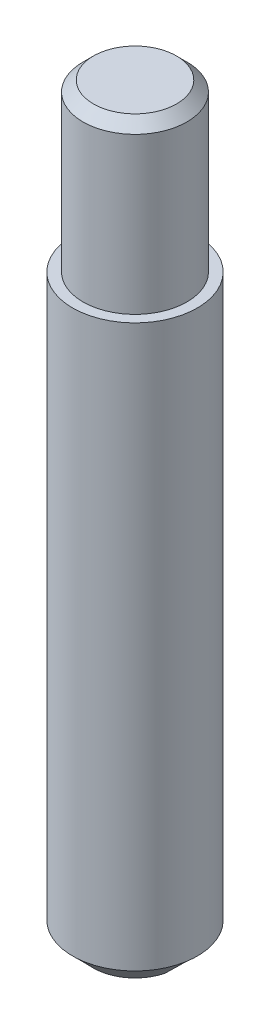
from build123d import *

# Parameters (mm, degrees)
SKETCH2_R      = 3
EXTRUDE1_DEPTH = 28
SKETCH3_R      = 2.5
EXTRUDE2_DEPTH = 8
CHAMFER1_SIZE  = 0.5
CHAMFER2_SIZE  = 1
EXTRUDE3_DEPTH = 1


with BuildPart() as part:
    # Sketch2 → Extrude1 (new body)
    with BuildSketch(Plane(origin=(0, 0, 0), x_dir=(1, 0, 0), z_dir=(0, 1, 0))):
        with Locations(Location((0, 0, 0), (0, 0, 270))):
            Circle(SKETCH2_R)
    extrude(amount=EXTRUDE1_DEPTH)

    # Sketch3 → Extrude2 (add)
    with BuildSketch(Plane(origin=(0, 28, 0), x_dir=(1, 0, 0), z_dir=(0, 1, 0))):
        with Locations(Location((0, 0, 0), (0, 0, 270))):
            Circle(SKETCH3_R)
    extrude(amount=EXTRUDE2_DEPTH)

    # Chamfer1
    chamfer1_edges = [part.edges().sort_by_distance(p)[0] for p in [
        (0, 36, -2.5),
    ]]
    chamfer(chamfer1_edges, length=CHAMFER1_SIZE)

    # Chamfer2
    chamfer2_edges = [part.edges().sort_by_distance(p)[0] for p in [
        (0, 0, -3),
    ]]
    chamfer(chamfer2_edges, length=CHAMFER2_SIZE)

    # Sketch4 → Extrude3 (cut)
    with BuildSketch(Plane.XZ):
        Polygon((-4.037389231, -0.5), (4.053603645, -0.5), (3.534742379, 0.5), (-3.940102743, 0.5), align=None)
    extrude(amount=-EXTRUDE3_DEPTH, mode=Mode.SUBTRACT)


solid = part.part
